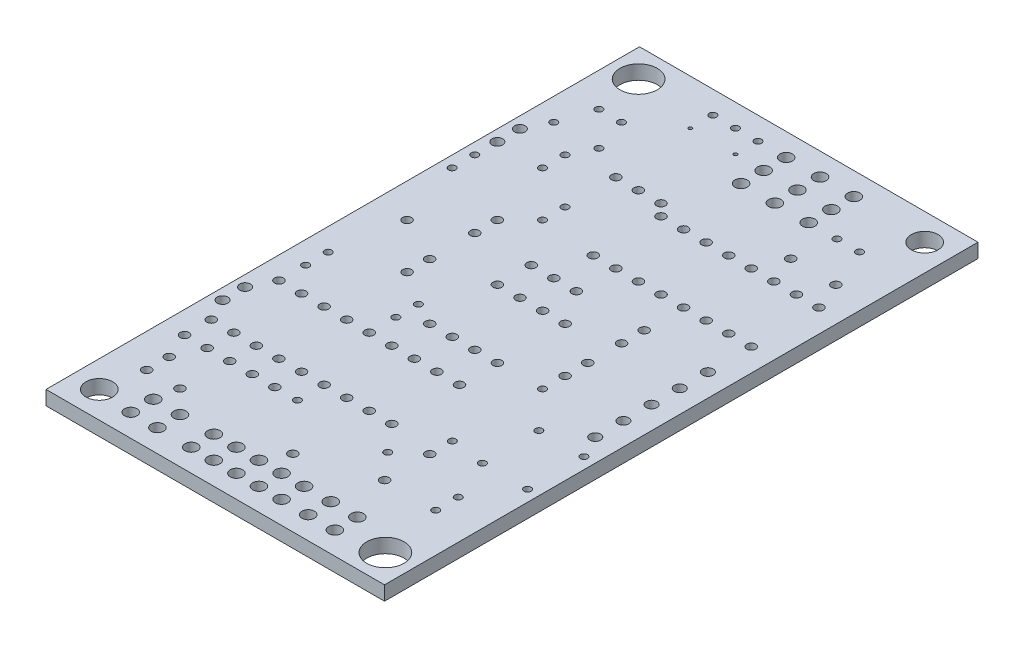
from build123d import *

# Parameters (mm, degrees)
ESQUISSE1_W        = 38.1
ESQUISSE1_H        = 66.8
ESQUISSE1_R        = 1.5
ESQUISSE1_R_2      = 2.1
ESQUISSE1_R_3      = 0.7
ESQUISSE1_R_4      = 0.5
ESQUISSE1_R_5      = 0.6
ESQUISSE1_R_6      = 0.4
ESQUISSE1_R_7      = 0.2
BOSS_EXTRU_1_DEPTH = 1.6


with BuildPart() as part:
    # Esquisse1 → Boss.-Extru.1 (new body)
    with BuildSketch(Plane(origin=(0, 0, 0), x_dir=(1, 0, 0), z_dir=(0, 1, 0))):
        with Locations((19.05, 33.4)):
            Rectangle(ESQUISSE1_W, ESQUISSE1_H)
        with Locations(Location((3, 3, 0), (0, 0, 270))):
            Circle(ESQUISSE1_R, mode=Mode.SUBTRACT)
        with Locations(Location((35, 3.2, 0), (0, 0, 270))):
            Circle(ESQUISSE1_R_2, mode=Mode.SUBTRACT)
        with Locations(Location((7, 2.54, 0), (0, 0, 270))):
            Circle(ESQUISSE1_R_3, mode=Mode.SUBTRACT)
        with Locations(Location((3.1, 63.6, 0), (0, 0, 270))):
            Circle(ESQUISSE1_R_2, mode=Mode.SUBTRACT)
        with Locations(Location((35.1, 63.8, 0), (0, 0, 270))):
            Circle(ESQUISSE1_R, mode=Mode.SUBTRACT)
        with Locations(Location((10, 2.54, 0), (0, 0, 270))):
            Circle(ESQUISSE1_R_3, mode=Mode.SUBTRACT)
        with Locations(Location((13.81, 2.54, 0), (0, 0, 270))):
            Circle(ESQUISSE1_R_3, mode=Mode.SUBTRACT)
        with Locations(Location((16.35, 2.54, 0), (0, 0, 270))):
            Circle(ESQUISSE1_R_3, mode=Mode.SUBTRACT)
        with Locations(Location((18.89, 2.54, 0), (0, 0, 270))):
            Circle(ESQUISSE1_R_3, mode=Mode.SUBTRACT)
        with Locations(Location((21.43, 2.54, 0), (0, 0, 270))):
            Circle(ESQUISSE1_R_3, mode=Mode.SUBTRACT)
        with Locations(Location((23.97, 2.54, 0), (0, 0, 270))):
            Circle(ESQUISSE1_R_3, mode=Mode.SUBTRACT)
        with Locations(Location((26.97, 2.54, 0), (0, 0, 270))):
            Circle(ESQUISSE1_R_3, mode=Mode.SUBTRACT)
        with Locations(Location((29.97, 2.54, 0), (0, 0, 270))):
            Circle(ESQUISSE1_R_3, mode=Mode.SUBTRACT)
        with Locations(Location((7, 5.08, 0), (0, 0, 270))):
            Circle(ESQUISSE1_R_3, mode=Mode.SUBTRACT)
        with Locations(Location((10, 5.08, 0), (0, 0, 270))):
            Circle(ESQUISSE1_R_3, mode=Mode.SUBTRACT)
        with Locations(Location((13.81, 5.08, 0), (0, 0, 270))):
            Circle(ESQUISSE1_R_3, mode=Mode.SUBTRACT)
        with Locations(Location((16.35, 5.08, 0), (0, 0, 270))):
            Circle(ESQUISSE1_R_3, mode=Mode.SUBTRACT)
        with Locations(Location((18.89, 5.08, 0), (0, 0, 270))):
            Circle(ESQUISSE1_R_3, mode=Mode.SUBTRACT)
        with Locations(Location((21.43, 5.08, 0), (0, 0, 270))):
            Circle(ESQUISSE1_R_3, mode=Mode.SUBTRACT)
        with Locations(Location((23.97, 5.08, 0), (0, 0, 270))):
            Circle(ESQUISSE1_R_3, mode=Mode.SUBTRACT)
        with Locations(Location((26.97, 5.08, 0), (0, 0, 270))):
            Circle(ESQUISSE1_R_3, mode=Mode.SUBTRACT)
        with Locations(Location((29.97, 5.08, 0), (0, 0, 270))):
            Circle(ESQUISSE1_R_3, mode=Mode.SUBTRACT)
        with Locations(Location((2.5, 13.1, 0), (0, 0, 270))):
            Circle(ESQUISSE1_R_4, mode=Mode.SUBTRACT)
        with Locations(Location((2.5, 16.1, 0), (0, 0, 270))):
            Circle(ESQUISSE1_R_4, mode=Mode.SUBTRACT)
        with Locations(Location((1.23, 18.64, 0), (0, 0, 270))):
            Circle(ESQUISSE1_R_5, mode=Mode.SUBTRACT)
        with Locations(Location((2.5, 26.72, 0), (0, 0, 270))):
            Circle(ESQUISSE1_R_6, mode=Mode.SUBTRACT)
        with Locations(Location((1.23, 21.18, 0), (0, 0, 270))):
            Circle(ESQUISSE1_R_5, mode=Mode.SUBTRACT)
        with Locations(Location((2.5, 29.26, 0), (0, 0, 270))):
            Circle(ESQUISSE1_R_6, mode=Mode.SUBTRACT)
        with Locations(Location((5.04, 13.1, 0), (0, 0, 270))):
            Circle(ESQUISSE1_R_4, mode=Mode.SUBTRACT)
        with Locations(Location((2.5, 23.72, 0), (0, 0, 270))):
            Circle(ESQUISSE1_R_4, mode=Mode.SUBTRACT)
        with Locations(Location((5.04, 16.1, 0), (0, 0, 270))):
            Circle(ESQUISSE1_R_4, mode=Mode.SUBTRACT)
        with Locations(Location((5.04, 23.72, 0), (0, 0, 270))):
            Circle(ESQUISSE1_R_4, mode=Mode.SUBTRACT)
        with Locations(Location((15.2, 35.61, 0), (0, 0, 270))):
            Circle(ESQUISSE1_R_4, mode=Mode.SUBTRACT)
        with Locations(Location((15.2, 27.99, 0), (0, 0, 270))):
            Circle(ESQUISSE1_R_4, mode=Mode.SUBTRACT)
        with Locations(Location((7.58, 13.1, 0), (0, 0, 270))):
            Circle(ESQUISSE1_R_4, mode=Mode.SUBTRACT)
        with Locations(Location((7.58, 16.1, 0), (0, 0, 270))):
            Circle(ESQUISSE1_R_4, mode=Mode.SUBTRACT)
        with Locations(Location((7.58, 23.72, 0), (0, 0, 270))):
            Circle(ESQUISSE1_R_4, mode=Mode.SUBTRACT)
        with Locations(Location((17.74, 27.99, 0), (0, 0, 270))):
            Circle(ESQUISSE1_R_4, mode=Mode.SUBTRACT)
        with Locations(Location((17.74, 35.61, 0), (0, 0, 270))):
            Circle(ESQUISSE1_R_4, mode=Mode.SUBTRACT)
        with Locations(Location((10.12, 13.1, 0), (0, 0, 270))):
            Circle(ESQUISSE1_R_4, mode=Mode.SUBTRACT)
        with Locations(Location((10.12, 16.1, 0), (0, 0, 270))):
            Circle(ESQUISSE1_R_4, mode=Mode.SUBTRACT)
        with Locations(Location((10.12, 23.72, 0), (0, 0, 270))):
            Circle(ESQUISSE1_R_4, mode=Mode.SUBTRACT)
        with Locations(Location((20.28, 27.99, 0), (0, 0, 270))):
            Circle(ESQUISSE1_R_4, mode=Mode.SUBTRACT)
        with Locations(Location((20.28, 35.61, 0), (0, 0, 270))):
            Circle(ESQUISSE1_R_4, mode=Mode.SUBTRACT)
        with Locations(Location((12.66, 13.1, 0), (0, 0, 270))):
            Circle(ESQUISSE1_R_4, mode=Mode.SUBTRACT)
        with Locations(Location((12.66, 16.1, 0), (0, 0, 270))):
            Circle(ESQUISSE1_R_4, mode=Mode.SUBTRACT)
        with Locations(Location((12.66, 23.72, 0), (0, 0, 270))):
            Circle(ESQUISSE1_R_4, mode=Mode.SUBTRACT)
        with Locations(Location((12.66, 26.72, 0), (0, 0, 270))):
            Circle(ESQUISSE1_R_6, mode=Mode.SUBTRACT)
        with Locations(Location((12.66, 29.26, 0), (0, 0, 270))):
            Circle(ESQUISSE1_R_6, mode=Mode.SUBTRACT)
        with Locations(Location((15.2, 13.1, 0), (0, 0, 270))):
            Circle(ESQUISSE1_R_6, mode=Mode.SUBTRACT)
        with Locations(Location((15.2, 16.1, 0), (0, 0, 270))):
            Circle(ESQUISSE1_R_4, mode=Mode.SUBTRACT)
        with Locations(Location((15.2, 23.72, 0), (0, 0, 270))):
            Circle(ESQUISSE1_R_4, mode=Mode.SUBTRACT)
        with Locations(Location((22.82, 27.99, 0), (0, 0, 270))):
            Circle(ESQUISSE1_R_4, mode=Mode.SUBTRACT)
        with Locations(Location((22.82, 35.61, 0), (0, 0, 270))):
            Circle(ESQUISSE1_R_4, mode=Mode.SUBTRACT)
        with Locations(Location((7.46, 7.62, 0), (0, 0, 270))):
            Circle(ESQUISSE1_R_4, mode=Mode.SUBTRACT)
        with Locations(Location((17.74, 16.1, 0), (0, 0, 270))):
            Circle(ESQUISSE1_R_4, mode=Mode.SUBTRACT)
        with Locations(Location((17.74, 23.72, 0), (0, 0, 270))):
            Circle(ESQUISSE1_R_4, mode=Mode.SUBTRACT)
        with Locations(Location((20.16, 7.62, 0), (0, 0, 270))):
            Circle(ESQUISSE1_R_4, mode=Mode.SUBTRACT)
        with Locations(Location((25.36, 13.1, 0), (0, 0, 270))):
            Circle(ESQUISSE1_R_6, mode=Mode.SUBTRACT)
        with Locations(Location((27.9, 27.99, 0), (0, 0, 270))):
            Circle(ESQUISSE1_R_6, mode=Mode.SUBTRACT)
        with Locations(Location((20.28, 16.1, 0), (0, 0, 270))):
            Circle(ESQUISSE1_R_4, mode=Mode.SUBTRACT)
        with Locations(Location((20.28, 23.72, 0), (0, 0, 270))):
            Circle(ESQUISSE1_R_4, mode=Mode.SUBTRACT)
        with Locations(Location((3.77, 10.1, 0), (0, 0, 270))):
            Circle(ESQUISSE1_R_4, mode=Mode.SUBTRACT)
        with Locations(Location((3.77, 7.56, 0), (0, 0, 270))):
            Circle(ESQUISSE1_R_4, mode=Mode.SUBTRACT)
        with Locations(Location((33.7, 10.16, 0), (0, 0, 270))):
            Circle(ESQUISSE1_R_6, mode=Mode.SUBTRACT)
        with Locations(Location((22.82, 16.1, 0), (0, 0, 270))):
            Circle(ESQUISSE1_R_4, mode=Mode.SUBTRACT)
        with Locations(Location((22.82, 23.72, 0), (0, 0, 270))):
            Circle(ESQUISSE1_R_4, mode=Mode.SUBTRACT)
        with Locations(Location((27.9, 17.83, 0), (0, 0, 270))):
            Circle(ESQUISSE1_R_6, mode=Mode.SUBTRACT)
        with Locations(Location((33.7, 12.7, 0), (0, 0, 270))):
            Circle(ESQUISSE1_R_6, mode=Mode.SUBTRACT)
        with Locations(Location((27.9, 15.29, 0), (0, 0, 270))):
            Circle(ESQUISSE1_R_4, mode=Mode.SUBTRACT)
        with Locations(Location((27.9, 10.21, 0), (0, 0, 270))):
            Circle(ESQUISSE1_R_4, mode=Mode.SUBTRACT)
        with Locations(Location((36.83, 17.37, 0), (0, 0, 270))):
            Circle(ESQUISSE1_R_6, mode=Mode.SUBTRACT)
        with Locations(Location((27.9, 30.53, 0), (0, 0, 270))):
            Circle(ESQUISSE1_R_4, mode=Mode.SUBTRACT)
        with Locations(Location((27.9, 33.07, 0), (0, 0, 270))):
            Circle(ESQUISSE1_R_4, mode=Mode.SUBTRACT)
        with Locations(Location((17.74, 43.86, 0), (0, 0, 270))):
            Circle(ESQUISSE1_R_4, mode=Mode.SUBTRACT)
        with Locations(Location((27.9, 36.88, 0), (0, 0, 270))):
            Circle(ESQUISSE1_R_4, mode=Mode.SUBTRACT)
        with Locations(Location((35.56, 26.26, 0), (0, 0, 270))):
            Circle(ESQUISSE1_R_5, mode=Mode.SUBTRACT)
        with Locations(Location((20.28, 43.86, 0), (0, 0, 270))):
            Circle(ESQUISSE1_R_4, mode=Mode.SUBTRACT)
        with Locations(Location((22.82, 43.86, 0), (0, 0, 270))):
            Circle(ESQUISSE1_R_4, mode=Mode.SUBTRACT)
        with Locations(Location((25.36, 43.86, 0), (0, 0, 270))):
            Circle(ESQUISSE1_R_4, mode=Mode.SUBTRACT)
        with Locations(Location((27.9, 43.86, 0), (0, 0, 270))):
            Circle(ESQUISSE1_R_4, mode=Mode.SUBTRACT)
        with Locations(Location((35.56, 29.43, 0), (0, 0, 270))):
            Circle(ESQUISSE1_R_5, mode=Mode.SUBTRACT)
        with Locations(Location((31.75, 17.37, 0), (0, 0, 270))):
            Circle(ESQUISSE1_R_6, mode=Mode.SUBTRACT)
        with Locations(Location((31.75, 23.72, 0), (0, 0, 270))):
            Circle(ESQUISSE1_R_6, mode=Mode.SUBTRACT)
        with Locations(Location((36.83, 23.72, 0), (0, 0, 270))):
            Circle(ESQUISSE1_R_6, mode=Mode.SUBTRACT)
        with Locations(Location((35.56, 32.6, 0), (0, 0, 270))):
            Circle(ESQUISSE1_R_5, mode=Mode.SUBTRACT)
        with Locations(Location((30.44, 43.86, 0), (0, 0, 270))):
            Circle(ESQUISSE1_R_4, mode=Mode.SUBTRACT)
        with Locations(Location((32.98, 43.86, 0), (0, 0, 270))):
            Circle(ESQUISSE1_R_4, mode=Mode.SUBTRACT)
        with Locations(Location((35.52, 43.86, 0), (0, 0, 270))):
            Circle(ESQUISSE1_R_4, mode=Mode.SUBTRACT)
        with Locations(Location((17.74, 51.48, 0), (0, 0, 270))):
            Circle(ESQUISSE1_R_4, mode=Mode.SUBTRACT)
        with Locations(Location((20.28, 51.48, 0), (0, 0, 270))):
            Circle(ESQUISSE1_R_4, mode=Mode.SUBTRACT)
        with Locations(Location((22.82, 51.48, 0), (0, 0, 270))):
            Circle(ESQUISSE1_R_4, mode=Mode.SUBTRACT)
        with Locations(Location((25.36, 51.48, 0), (0, 0, 270))):
            Circle(ESQUISSE1_R_4, mode=Mode.SUBTRACT)
        with Locations(Location((27.9, 51.48, 0), (0, 0, 270))):
            Circle(ESQUISSE1_R_4, mode=Mode.SUBTRACT)
        with Locations(Location((30.44, 51.48, 0), (0, 0, 270))):
            Circle(ESQUISSE1_R_4, mode=Mode.SUBTRACT)
        with Locations(Location((32.98, 51.48, 0), (0, 0, 270))):
            Circle(ESQUISSE1_R_4, mode=Mode.SUBTRACT)
        with Locations(Location((35.52, 51.48, 0), (0, 0, 270))):
            Circle(ESQUISSE1_R_4, mode=Mode.SUBTRACT)
        with Locations(Location((35.56, 35.77, 0), (0, 0, 270))):
            Circle(ESQUISSE1_R_5, mode=Mode.SUBTRACT)
        with Locations(Location((35.56, 38.94, 0), (0, 0, 270))):
            Circle(ESQUISSE1_R_5, mode=Mode.SUBTRACT)
        with Locations(Location((26.67, 64.26, 0), (0, 0, 270))):
            Circle(ESQUISSE1_R_3, mode=Mode.SUBTRACT)
        with Locations(Location((22.86, 64.26, 0), (0, 0, 270))):
            Circle(ESQUISSE1_R_3, mode=Mode.SUBTRACT)
        with Locations(Location((19.05, 64.26, 0), (0, 0, 270))):
            Circle(ESQUISSE1_R_3, mode=Mode.SUBTRACT)
        with Locations(Location((15.88, 64.26, 0), (0, 0, 270))):
            Circle(ESQUISSE1_R_6, mode=Mode.SUBTRACT)
        with Locations(Location((13.34, 64.26, 0), (0, 0, 270))):
            Circle(ESQUISSE1_R_6, mode=Mode.SUBTRACT)
        with Locations(Location((10.8, 64.26, 0), (0, 0, 270))):
            Circle(ESQUISSE1_R_6, mode=Mode.SUBTRACT)
        with Locations(Location((26.67, 61.72, 0), (0, 0, 270))):
            Circle(ESQUISSE1_R_3, mode=Mode.SUBTRACT)
        with Locations(Location((22.86, 61.72, 0), (0, 0, 270))):
            Circle(ESQUISSE1_R_3, mode=Mode.SUBTRACT)
        with Locations(Location((19.05, 61.72, 0), (0, 0, 270))):
            Circle(ESQUISSE1_R_3, mode=Mode.SUBTRACT)
        with Locations(Location((15.88, 61.72, 0), (0, 0, 270))):
            Circle(ESQUISSE1_R_7, mode=Mode.SUBTRACT)
        with Locations(Location((29.84, 59.18, 0), (0, 0, 270))):
            Circle(ESQUISSE1_R_6, mode=Mode.SUBTRACT)
        with Locations(Location((10.8, 61.72, 0), (0, 0, 270))):
            Circle(ESQUISSE1_R_7, mode=Mode.SUBTRACT)
        with Locations(Location((26.67, 59.18, 0), (0, 0, 270))):
            Circle(ESQUISSE1_R_3, mode=Mode.SUBTRACT)
        with Locations(Location((22.86, 59.18, 0), (0, 0, 270))):
            Circle(ESQUISSE1_R_3, mode=Mode.SUBTRACT)
        with Locations(Location((19.05, 59.18, 0), (0, 0, 270))):
            Circle(ESQUISSE1_R_3, mode=Mode.SUBTRACT)
        with Locations(Location((32.38, 59.18, 0), (0, 0, 270))):
            Circle(ESQUISSE1_R_6, mode=Mode.SUBTRACT)
        with Locations(Location((29.17, 54.65, 0), (0, 0, 270))):
            Circle(ESQUISSE1_R_4, mode=Mode.SUBTRACT)
        with Locations(Location((34.25, 54.65, 0), (0, 0, 270))):
            Circle(ESQUISSE1_R_4, mode=Mode.SUBTRACT)
        with Locations(Location((13.93, 52.75, 0), (0, 0, 270))):
            Circle(ESQUISSE1_R_4, mode=Mode.SUBTRACT)
        with Locations(Location((16.47, 52.75, 0), (0, 0, 270))):
            Circle(ESQUISSE1_R_4, mode=Mode.SUBTRACT)
        with Locations(Location((11.39, 52.75, 0), (0, 0, 270))):
            Circle(ESQUISSE1_R_4, mode=Mode.SUBTRACT)
        with Locations(Location((15.2, 39.42, 0), (0, 0, 270))):
            Circle(ESQUISSE1_R_4, mode=Mode.SUBTRACT)
        with Locations(Location((17.74, 39.42, 0), (0, 0, 270))):
            Circle(ESQUISSE1_R_4, mode=Mode.SUBTRACT)
        with Locations(Location((20.28, 39.42, 0), (0, 0, 270))):
            Circle(ESQUISSE1_R_4, mode=Mode.SUBTRACT)
        with Locations(Location((1.269050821, 52.06839999, 0), (0, 0, 270))):
            Circle(ESQUISSE1_R_5, mode=Mode.SUBTRACT)
        with Locations(Location((1.269050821, 49.52839999, 0), (0, 0, 270))):
            Circle(ESQUISSE1_R_5, mode=Mode.SUBTRACT)
        with Locations(Location((1.269050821, 46.98839999, 0), (0, 0, 270))):
            Circle(ESQUISSE1_R_6, mode=Mode.SUBTRACT)
        with Locations(Location((1.269050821, 44.44839999, 0), (0, 0, 270))):
            Circle(ESQUISSE1_R_6, mode=Mode.SUBTRACT)
        with Locations(Location((27.9, 39.42, 0), (0, 0, 270))):
            Circle(ESQUISSE1_R_4, mode=Mode.SUBTRACT)
        with Locations(Location((6.349050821, 49.52839999, 0), (0, 0, 270))):
            Circle(ESQUISSE1_R_6, mode=Mode.SUBTRACT)
        with Locations(Location((3.809050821, 36.82839999, 0), (0, 0, 270))):
            Circle(ESQUISSE1_R_4, mode=Mode.SUBTRACT)
        with Locations(Location((8.889050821, 41.90839999, 0), (0, 0, 270))):
            Circle(ESQUISSE1_R_4, mode=Mode.SUBTRACT)
        with Locations(Location((6.349050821, 52.06839999, 0), (0, 0, 270))):
            Circle(ESQUISSE1_R_6, mode=Mode.SUBTRACT)
        with Locations(Location((8.889050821, 39.36839999, 0), (0, 0, 270))):
            Circle(ESQUISSE1_R_4, mode=Mode.SUBTRACT)
        with Locations(Location((2.540019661, 54.610118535, 0), (0, 0, 270))):
            Circle(ESQUISSE1_R_6, mode=Mode.SUBTRACT)
        with Locations(Location((7.620019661, 54.610118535, 0), (0, 0, 270))):
            Circle(ESQUISSE1_R_6, mode=Mode.SUBTRACT)
        with Locations(Location((8.889050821, 34.28839999, 0), (0, 0, 270))):
            Circle(ESQUISSE1_R_4, mode=Mode.SUBTRACT)
        with Locations(Location((8.889050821, 31.74839999, 0), (0, 0, 270))):
            Circle(ESQUISSE1_R_4, mode=Mode.SUBTRACT)
        with Locations(Location((6.349050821, 58.421803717, 0), (0, 0, 270))):
            Circle(ESQUISSE1_R_6, mode=Mode.SUBTRACT)
        with Locations(Location((3.809050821, 58.421803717, 0), (0, 0, 270))):
            Circle(ESQUISSE1_R_6, mode=Mode.SUBTRACT)
        with Locations(Location((11.429050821, 44.44839999, 0), (0, 0, 270))):
            Circle(ESQUISSE1_R_6, mode=Mode.SUBTRACT)
        with Locations(Location((11.429050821, 46.98839999, 0), (0, 0, 270))):
            Circle(ESQUISSE1_R_6, mode=Mode.SUBTRACT)
    extrude(amount=BOSS_EXTRU_1_DEPTH)


solid = part.part
